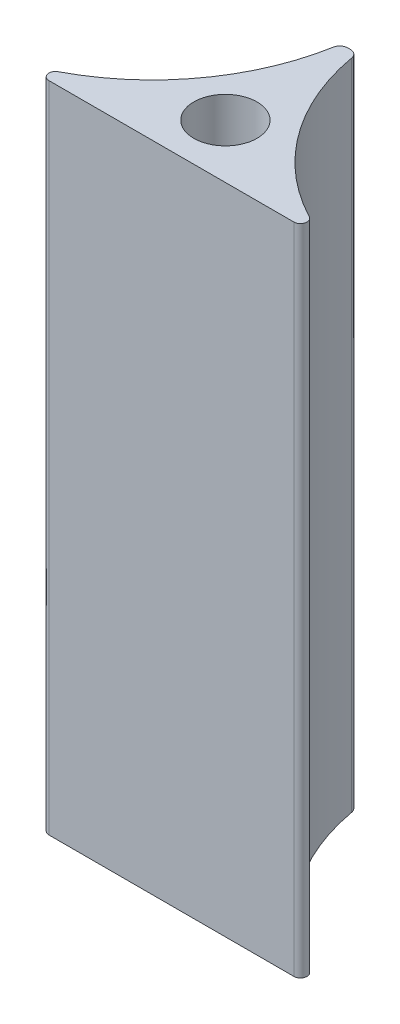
ISO-10303-21;
HEADER;
FILE_DESCRIPTION(('STEP AP214'),'2;1');
FILE_NAME('part.step','',(''),(''),'','','');
FILE_SCHEMA(('AUTOMOTIVE_DESIGN { 1 0 10303 214 1 1 1 1 }'));
ENDSEC;
DATA;
#1=APPLICATION_CONTEXT('core data for automotive mechanical design processes');
#2=APPLICATION_PROTOCOL_DEFINITION('international standard','automotive_design',2000,#1);
#3=PRODUCT_CONTEXT('',#1,'mechanical');
#4=PRODUCT('Part','Part','',(#3));
#5=PRODUCT_RELATED_PRODUCT_CATEGORY('part','',(#4));
#6=PRODUCT_DEFINITION_FORMATION('','',#4);
#7=PRODUCT_DEFINITION_CONTEXT('part definition',#1,'design');
#8=PRODUCT_DEFINITION('design','',#6,#7);
#9=PRODUCT_DEFINITION_SHAPE('','',#8);
#10=(LENGTH_UNIT() NAMED_UNIT(*) SI_UNIT(.MILLI.,.METRE.));
#11=(NAMED_UNIT(*) PLANE_ANGLE_UNIT() SI_UNIT($,.RADIAN.));
#12=(NAMED_UNIT(*) SI_UNIT($,.STERADIAN.) SOLID_ANGLE_UNIT());
#13=UNCERTAINTY_MEASURE_WITH_UNIT(LENGTH_MEASURE(1.E-05),#10,'distance_accuracy_value','');
#14=(GEOMETRIC_REPRESENTATION_CONTEXT(3) GLOBAL_UNCERTAINTY_ASSIGNED_CONTEXT((#13)) GLOBAL_UNIT_ASSIGNED_CONTEXT((#10,
#11,#12)) REPRESENTATION_CONTEXT('',''));
#15=CARTESIAN_POINT('',(0.,0.,0.));
#16=DIRECTION('',(0.,0.,1.));
#17=DIRECTION('',(1.,0.,0.));
#18=AXIS2_PLACEMENT_3D('',#15,#16,#17);
#19=CARTESIAN_POINT('',(17.8476000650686,50.8,0.));
#20=DIRECTION('',(0.,-1.,0.));
#21=DIRECTION('',(0.,0.,-1.));
#22=AXIS2_PLACEMENT_3D('',#19,#20,#21);
#23=CYLINDRICAL_SURFACE('',#22,17.399);
#24=CARTESIAN_POINT('',(17.8476000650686,0.,0.));
#25=DIRECTION('',(0.,-1.,0.));
#26=DIRECTION('',(0.,0.,-1.));
#27=AXIS2_PLACEMENT_3D('',#24,#25,#26);
#28=CIRCLE('',#27,17.399);
#29=CARTESIAN_POINT('',(9.76110212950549,0.,15.4056402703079));
#30=VERTEX_POINT('',#29);
#31=CARTESIAN_POINT('',(0.720370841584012,0.,3.06320422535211));
#32=VERTEX_POINT('',#31);
#33=EDGE_CURVE('E135',#30,#32,#28,.T.);
#34=ORIENTED_EDGE('',*,*,#33,.T.);
#35=DIRECTION('',(0.,-1.,0.));
#36=VECTOR('',#35,1.);
#37=CARTESIAN_POINT('',(0.720370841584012,50.8,3.06320422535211));
#38=LINE('',#37,#36);
#39=CARTESIAN_POINT('',(0.720370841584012,50.8,3.06320422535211));
#40=VERTEX_POINT('',#39);
#41=EDGE_CURVE('E11',#32,#40,#38,.F.);
#42=ORIENTED_EDGE('',*,*,#41,.T.);
#43=CARTESIAN_POINT('',(17.8476000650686,50.8,0.));
#44=DIRECTION('',(0.,-1.,0.));
#45=DIRECTION('',(0.,0.,-1.));
#46=AXIS2_PLACEMENT_3D('',#43,#44,#45);
#47=CIRCLE('',#46,17.399);
#48=CARTESIAN_POINT('',(9.76110212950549,50.8,15.4056402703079));
#49=VERTEX_POINT('',#48);
#50=EDGE_CURVE('E147',#49,#40,#47,.T.);
#51=ORIENTED_EDGE('',*,*,#50,.F.);
#52=DIRECTION('',(0.,-1.,0.));
#53=VECTOR('',#52,1.);
#54=CARTESIAN_POINT('',(9.76110212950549,50.8,15.4056402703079));
#55=LINE('',#54,#53);
#56=EDGE_CURVE('E134',#49,#30,#55,.T.);
#57=ORIENTED_EDGE('',*,*,#56,.T.);
#58=EDGE_LOOP('',(#34,#42,#51,#57));
#59=FACE_BOUND('',#58,.T.);
#60=ADVANCED_FACE('F36',(#59),#23,.F.);
#61=CARTESIAN_POINT('',(0.635000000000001,50.8,2.54));
#62=DIRECTION('',(0.,0.,1.));
#63=DIRECTION('',(1.,0.,0.));
#64=AXIS2_PLACEMENT_3D('',#61,#62,#63);
#65=PLANE('',#64);
#66=DIRECTION('',(-1.,0.,0.));
#67=VECTOR('',#66,1.);
#68=CARTESIAN_POINT('',(0.635000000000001,0.,2.54));
#69=LINE('',#68,#67);
#70=CARTESIAN_POINT('',(0.0952894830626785,0.,2.54));
#71=VERTEX_POINT('',#70);
#72=CARTESIAN_POINT('',(-0.0952894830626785,0.,2.54));
#73=VERTEX_POINT('',#72);
#74=EDGE_CURVE('E137',#71,#73,#69,.T.);
#75=ORIENTED_EDGE('',*,*,#74,.T.);
#76=DIRECTION('',(0.,-1.,0.));
#77=VECTOR('',#76,1.);
#78=CARTESIAN_POINT('',(-0.0952894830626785,50.8,2.54));
#79=LINE('',#78,#77);
#80=CARTESIAN_POINT('',(-0.0952894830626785,50.8,2.54));
#81=VERTEX_POINT('',#80);
#82=EDGE_CURVE('E57',#73,#81,#79,.F.);
#83=ORIENTED_EDGE('',*,*,#82,.T.);
#84=DIRECTION('',(-1.,0.,0.));
#85=VECTOR('',#84,1.);
#86=CARTESIAN_POINT('',(0.635000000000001,50.8,2.54));
#87=LINE('',#86,#85);
#88=CARTESIAN_POINT('',(0.0952894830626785,50.8,2.54));
#89=VERTEX_POINT('',#88);
#90=EDGE_CURVE('E112',#89,#81,#87,.T.);
#91=ORIENTED_EDGE('',*,*,#90,.F.);
#92=DIRECTION('',(0.,-1.,0.));
#93=VECTOR('',#92,1.);
#94=CARTESIAN_POINT('',(0.0952894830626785,50.8,2.54));
#95=LINE('',#94,#93);
#96=EDGE_CURVE('E159',#89,#71,#95,.T.);
#97=ORIENTED_EDGE('',*,*,#96,.T.);
#98=EDGE_LOOP('',(#75,#83,#91,#97));
#99=FACE_BOUND('',#98,.T.);
#100=ADVANCED_FACE('F167',(#99),#65,.F.);
#101=CARTESIAN_POINT('',(-17.8476000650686,50.8,0.));
#102=DIRECTION('',(0.,-1.,0.));
#103=DIRECTION('',(0.,0.,-1.));
#104=AXIS2_PLACEMENT_3D('',#101,#102,#103);
#105=CYLINDRICAL_SURFACE('',#104,17.399);
#106=CARTESIAN_POINT('',(-17.8476000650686,50.8,0.));
#107=DIRECTION('',(0.,-1.,0.));
#108=DIRECTION('',(0.,0.,1.));
#109=AXIS2_PLACEMENT_3D('',#106,#107,#108);
#110=CIRCLE('',#109,17.399);
#111=CARTESIAN_POINT('',(-0.720370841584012,50.8,3.06320422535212));
#112=VERTEX_POINT('',#111);
#113=CARTESIAN_POINT('',(-9.76110212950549,50.8,15.4056402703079));
#114=VERTEX_POINT('',#113);
#115=EDGE_CURVE('E102',#112,#114,#110,.T.);
#116=ORIENTED_EDGE('',*,*,#115,.F.);
#117=DIRECTION('',(0.,-1.,0.));
#118=VECTOR('',#117,1.);
#119=CARTESIAN_POINT('',(-0.720370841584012,50.8,3.06320422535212));
#120=LINE('',#119,#118);
#121=CARTESIAN_POINT('',(-0.720370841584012,0.,3.06320422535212));
#122=VERTEX_POINT('',#121);
#123=EDGE_CURVE('E121',#112,#122,#120,.T.);
#124=ORIENTED_EDGE('',*,*,#123,.T.);
#125=CARTESIAN_POINT('',(-17.8476000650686,0.,0.));
#126=DIRECTION('',(0.,-1.,0.));
#127=DIRECTION('',(0.,0.,1.));
#128=AXIS2_PLACEMENT_3D('',#125,#126,#127);
#129=CIRCLE('',#128,17.399);
#130=CARTESIAN_POINT('',(-9.76110212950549,0.,15.4056402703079));
#131=VERTEX_POINT('',#130);
#132=EDGE_CURVE('E118',#122,#131,#129,.T.);
#133=ORIENTED_EDGE('',*,*,#132,.T.);
#134=DIRECTION('',(0.,-1.,0.));
#135=VECTOR('',#134,1.);
#136=CARTESIAN_POINT('',(-9.76110212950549,50.8,15.4056402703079));
#137=LINE('',#136,#135);
#138=EDGE_CURVE('E115',#114,#131,#137,.T.);
#139=ORIENTED_EDGE('',*,*,#138,.F.);
#140=EDGE_LOOP('',(#116,#124,#133,#139));
#141=FACE_BOUND('',#140,.T.);
#142=ADVANCED_FACE('F116',(#141),#105,.F.);
#143=CARTESIAN_POINT('',(-9.525,50.8,15.8554399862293));
#144=DIRECTION('',(0.,-1.,0.));
#145=DIRECTION('',(0.,0.,-1.));
#146=AXIS2_PLACEMENT_3D('',#143,#144,#145);
#147=CYLINDRICAL_SURFACE('',#146,0.508);
#148=CARTESIAN_POINT('',(-9.525,0.,15.8554399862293));
#149=DIRECTION('',(0.,1.,0.));
#150=DIRECTION('',(0.,0.,-1.));
#151=AXIS2_PLACEMENT_3D('',#148,#149,#150);
#152=CIRCLE('',#151,0.508);
#153=CARTESIAN_POINT('',(-9.525,0.,16.3634399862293));
#154=VERTEX_POINT('',#153);
#155=EDGE_CURVE('E141',#131,#154,#152,.T.);
#156=ORIENTED_EDGE('',*,*,#155,.T.);
#157=DIRECTION('',(0.,-1.,0.));
#158=VECTOR('',#157,1.);
#159=CARTESIAN_POINT('',(-9.525,50.8,16.3634399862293));
#160=LINE('',#159,#158);
#161=CARTESIAN_POINT('',(-9.525,50.8,16.3634399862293));
#162=VERTEX_POINT('',#161);
#163=EDGE_CURVE('E122',#162,#154,#160,.T.);
#164=ORIENTED_EDGE('',*,*,#163,.F.);
#165=CARTESIAN_POINT('',(-9.525,50.8,15.8554399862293));
#166=DIRECTION('',(0.,1.,0.));
#167=DIRECTION('',(0.,0.,-1.));
#168=AXIS2_PLACEMENT_3D('',#165,#166,#167);
#169=CIRCLE('',#168,0.508);
#170=EDGE_CURVE('E106',#114,#162,#169,.T.);
#171=ORIENTED_EDGE('',*,*,#170,.F.);
#172=ORIENTED_EDGE('',*,*,#138,.T.);
#173=EDGE_LOOP('',(#156,#164,#171,#172));
#174=FACE_BOUND('',#173,.T.);
#175=ADVANCED_FACE('F124',(#174),#147,.T.);
#176=CARTESIAN_POINT('',(9.525,50.8,16.3634399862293));
#177=DIRECTION('',(0.,0.,-1.));
#178=DIRECTION('',(-1.,0.,0.));
#179=AXIS2_PLACEMENT_3D('',#176,#177,#178);
#180=PLANE('',#179);
#181=DIRECTION('',(1.,0.,0.));
#182=VECTOR('',#181,1.);
#183=CARTESIAN_POINT('',(9.525,0.,16.3634399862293));
#184=LINE('',#183,#182);
#185=CARTESIAN_POINT('',(9.525,0.,16.3634399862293));
#186=VERTEX_POINT('',#185);
#187=EDGE_CURVE('E143',#154,#186,#184,.T.);
#188=ORIENTED_EDGE('',*,*,#187,.T.);
#189=DIRECTION('',(0.,-1.,0.));
#190=VECTOR('',#189,1.);
#191=CARTESIAN_POINT('',(9.525,50.8,16.3634399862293));
#192=LINE('',#191,#190);
#193=CARTESIAN_POINT('',(9.525,50.8,16.3634399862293));
#194=VERTEX_POINT('',#193);
#195=EDGE_CURVE('E150',#194,#186,#192,.T.);
#196=ORIENTED_EDGE('',*,*,#195,.F.);
#197=DIRECTION('',(1.,0.,0.));
#198=VECTOR('',#197,1.);
#199=CARTESIAN_POINT('',(9.525,50.8,16.3634399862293));
#200=LINE('',#199,#198);
#201=EDGE_CURVE('E127',#162,#194,#200,.T.);
#202=ORIENTED_EDGE('',*,*,#201,.F.);
#203=ORIENTED_EDGE('',*,*,#163,.T.);
#204=EDGE_LOOP('',(#188,#196,#202,#203));
#205=FACE_BOUND('',#204,.T.);
#206=ADVANCED_FACE('F180',(#205),#180,.F.);
#207=CARTESIAN_POINT('',(9.525,50.8,15.8554399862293));
#208=DIRECTION('',(0.,-1.,0.));
#209=DIRECTION('',(0.,0.,-1.));
#210=AXIS2_PLACEMENT_3D('',#207,#208,#209);
#211=CYLINDRICAL_SURFACE('',#210,0.507999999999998);
#212=CARTESIAN_POINT('',(9.525,0.,15.8554399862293));
#213=DIRECTION('',(0.,1.,0.));
#214=DIRECTION('',(0.,0.,1.));
#215=AXIS2_PLACEMENT_3D('',#212,#213,#214);
#216=CIRCLE('',#215,0.507999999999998);
#217=EDGE_CURVE('E145',#186,#30,#216,.T.);
#218=ORIENTED_EDGE('',*,*,#217,.T.);
#219=ORIENTED_EDGE('',*,*,#56,.F.);
#220=CARTESIAN_POINT('',(9.525,50.8,15.8554399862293));
#221=DIRECTION('',(0.,1.,0.));
#222=DIRECTION('',(0.,0.,1.));
#223=AXIS2_PLACEMENT_3D('',#220,#221,#222);
#224=CIRCLE('',#223,0.507999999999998);
#225=EDGE_CURVE('E129',#194,#49,#224,.T.);
#226=ORIENTED_EDGE('',*,*,#225,.F.);
#227=ORIENTED_EDGE('',*,*,#195,.T.);
#228=EDGE_LOOP('',(#218,#219,#226,#227));
#229=FACE_BOUND('',#228,.T.);
#230=ADVANCED_FACE('F176',(#229),#211,.T.);
#231=CARTESIAN_POINT('',(17.8476000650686,50.8,0.));
#232=DIRECTION('',(0.,-1.,0.));
#233=DIRECTION('',(0.,0.,-1.));
#234=AXIS2_PLACEMENT_3D('',#231,#232,#233);
#235=PLANE('',#234);
#236=CARTESIAN_POINT('',(0.,50.8,12.1638946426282));
#237=DIRECTION('',(0.,1.,0.));
#238=DIRECTION('',(0.,0.,1.));
#239=AXIS2_PLACEMENT_3D('',#236,#237,#238);
#240=CIRCLE('',#239,2.45744999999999);
#241=CARTESIAN_POINT('',(0.,50.8,14.6213446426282));
#242=VERTEX_POINT('',#241);
#243=EDGE_CURVE('E220',#242,#242,#240,.T.);
#244=ORIENTED_EDGE('',*,*,#243,.F.);
#245=EDGE_LOOP('',(#244));
#246=FACE_BOUND('',#245,.T.);
#247=ORIENTED_EDGE('',*,*,#90,.T.);
#248=CARTESIAN_POINT('',(-0.0952894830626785,50.8,3.175));
#249=DIRECTION('',(0.,-1.,0.));
#250=DIRECTION('',(0.,0.,-1.));
#251=AXIS2_PLACEMENT_3D('',#248,#249,#250);
#252=CIRCLE('',#251,0.635);
#253=EDGE_CURVE('E44',#81,#112,#252,.F.);
#254=ORIENTED_EDGE('',*,*,#253,.T.);
#255=ORIENTED_EDGE('',*,*,#115,.T.);
#256=ORIENTED_EDGE('',*,*,#170,.T.);
#257=ORIENTED_EDGE('',*,*,#201,.T.);
#258=ORIENTED_EDGE('',*,*,#225,.T.);
#259=ORIENTED_EDGE('',*,*,#50,.T.);
#260=CARTESIAN_POINT('',(0.0952894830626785,50.8,3.175));
#261=DIRECTION('',(0.,-1.,0.));
#262=DIRECTION('',(0.,0.,-1.));
#263=AXIS2_PLACEMENT_3D('',#260,#261,#262);
#264=CIRCLE('',#263,0.635);
#265=EDGE_CURVE('E163',#40,#89,#264,.F.);
#266=ORIENTED_EDGE('',*,*,#265,.T.);
#267=EDGE_LOOP('',(#247,#254,#255,#256,#257,#258,#259,#266));
#268=FACE_BOUND('',#267,.T.);
#269=ADVANCED_FACE('F104',(#246,#268),#235,.F.);
#270=CARTESIAN_POINT('',(17.8476000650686,0.,0.));
#271=DIRECTION('',(0.,-1.,0.));
#272=DIRECTION('',(0.,0.,-1.));
#273=AXIS2_PLACEMENT_3D('',#270,#271,#272);
#274=PLANE('',#273);
#275=CARTESIAN_POINT('',(0.,0.,12.1638946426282));
#276=DIRECTION('',(0.,1.,0.));
#277=DIRECTION('',(0.,0.,1.));
#278=AXIS2_PLACEMENT_3D('',#275,#276,#277);
#279=CIRCLE('',#278,2.45744999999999);
#280=CARTESIAN_POINT('',(0.,0.,14.6213446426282));
#281=VERTEX_POINT('',#280);
#282=EDGE_CURVE('E138',#281,#281,#279,.T.);
#283=ORIENTED_EDGE('',*,*,#282,.T.);
#284=EDGE_LOOP('',(#283));
#285=FACE_BOUND('',#284,.T.);
#286=ORIENTED_EDGE('',*,*,#132,.F.);
#287=CARTESIAN_POINT('',(-0.0952894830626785,0.,3.175));
#288=DIRECTION('',(0.,-1.,0.));
#289=DIRECTION('',(0.,0.,-1.));
#290=AXIS2_PLACEMENT_3D('',#287,#288,#289);
#291=CIRCLE('',#290,0.635);
#292=EDGE_CURVE('E157',#122,#73,#291,.T.);
#293=ORIENTED_EDGE('',*,*,#292,.T.);
#294=ORIENTED_EDGE('',*,*,#74,.F.);
#295=CARTESIAN_POINT('',(0.0952894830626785,0.,3.175));
#296=DIRECTION('',(0.,-1.,0.));
#297=DIRECTION('',(0.,0.,-1.));
#298=AXIS2_PLACEMENT_3D('',#295,#296,#297);
#299=CIRCLE('',#298,0.635);
#300=EDGE_CURVE('E155',#71,#32,#299,.T.);
#301=ORIENTED_EDGE('',*,*,#300,.T.);
#302=ORIENTED_EDGE('',*,*,#33,.F.);
#303=ORIENTED_EDGE('',*,*,#217,.F.);
#304=ORIENTED_EDGE('',*,*,#187,.F.);
#305=ORIENTED_EDGE('',*,*,#155,.F.);
#306=EDGE_LOOP('',(#286,#293,#294,#301,#302,#303,#304,#305));
#307=FACE_BOUND('',#306,.T.);
#308=ADVANCED_FACE('F171',(#285,#307),#274,.T.);
#309=CARTESIAN_POINT('',(0.,50.8,12.1638946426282));
#310=DIRECTION('',(0.,1.,0.));
#311=DIRECTION('',(0.,0.,1.));
#312=AXIS2_PLACEMENT_3D('',#309,#310,#311);
#313=CYLINDRICAL_SURFACE('',#312,2.45744999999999);
#314=ORIENTED_EDGE('',*,*,#282,.F.);
#315=EDGE_LOOP('',(#314));
#316=FACE_BOUND('',#315,.T.);
#317=ORIENTED_EDGE('',*,*,#243,.T.);
#318=EDGE_LOOP('',(#317));
#319=FACE_BOUND('',#318,.T.);
#320=ADVANCED_FACE('F198',(#316,#319),#313,.F.);
#321=CARTESIAN_POINT('',(-0.0952894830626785,50.8,3.175));
#322=DIRECTION('',(0.,-1.,0.));
#323=DIRECTION('',(0.,0.,-1.));
#324=AXIS2_PLACEMENT_3D('',#321,#322,#323);
#325=CYLINDRICAL_SURFACE('',#324,0.635);
#326=ORIENTED_EDGE('',*,*,#253,.F.);
#327=ORIENTED_EDGE('',*,*,#82,.F.);
#328=ORIENTED_EDGE('',*,*,#292,.F.);
#329=ORIENTED_EDGE('',*,*,#123,.F.);
#330=EDGE_LOOP('',(#326,#327,#328,#329));
#331=FACE_BOUND('',#330,.T.);
#332=ADVANCED_FACE('F196',(#331),#325,.T.);
#333=CARTESIAN_POINT('',(0.0952894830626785,50.8,3.175));
#334=DIRECTION('',(0.,-1.,0.));
#335=DIRECTION('',(0.,0.,-1.));
#336=AXIS2_PLACEMENT_3D('',#333,#334,#335);
#337=CYLINDRICAL_SURFACE('',#336,0.635);
#338=ORIENTED_EDGE('',*,*,#265,.F.);
#339=ORIENTED_EDGE('',*,*,#41,.F.);
#340=ORIENTED_EDGE('',*,*,#300,.F.);
#341=ORIENTED_EDGE('',*,*,#96,.F.);
#342=EDGE_LOOP('',(#338,#339,#340,#341));
#343=FACE_BOUND('',#342,.T.);
#344=ADVANCED_FACE('F38',(#343),#337,.T.);
#345=CLOSED_SHELL('',(#60,#100,#142,#175,#206,#230,#269,#308,#320,#332,#344));
#346=MANIFOLD_SOLID_BREP('B2',#345);
#347=ADVANCED_BREP_SHAPE_REPRESENTATION('',(#18,#346),#14);
#348=SHAPE_DEFINITION_REPRESENTATION(#9,#347);
ENDSEC;
END-ISO-10303-21;
